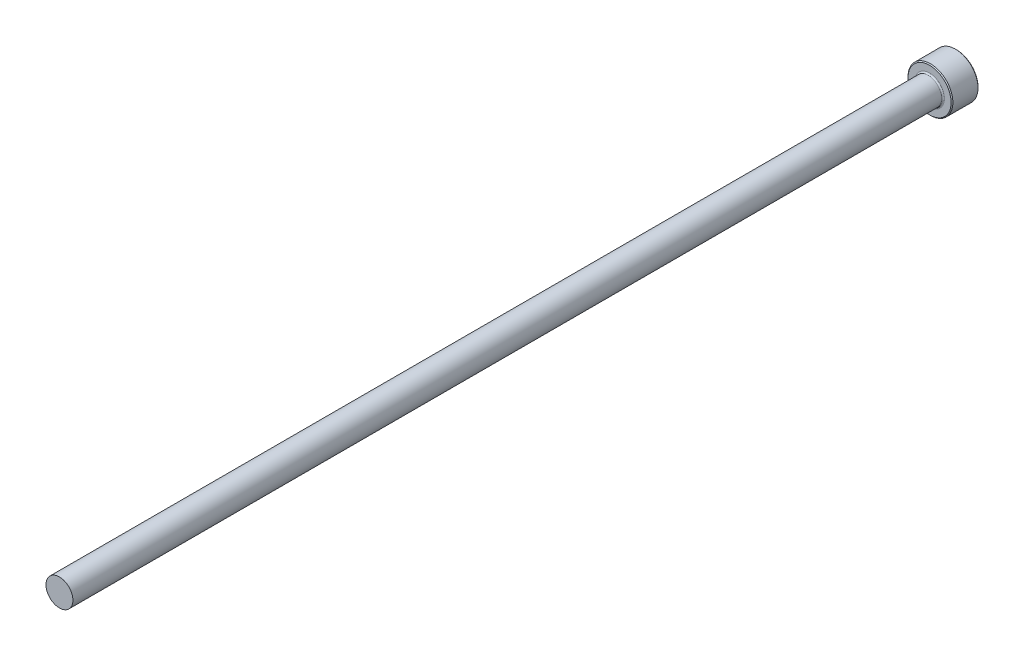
from build123d import *

# Parameters (mm, degrees)
CHAMFER1_SIZE = 0.2


with BuildPart() as part:
    # Sketch1 → Revolve1 (revolve)
    with BuildSketch(Plane(origin=(0, 0, 0), x_dir=(0, 0, -1), z_dir=(1, 0, 0)), mode=Mode.PRIVATE) as revolve1_sk:
        with BuildLine():
            Line((0, 0), (0, 5))
            Line((0, 5), (-6, 5))
            Line((-6, 5), (-6, 3.3))
            ThreePointArc((-6, 3.3), (-6.087867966, 3.087867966), (-6.3, 3))
            Line((-6.3, 3), (-200, 3))
            Line((-200, 3), (-200, 0))
            Line((-200, 0), (0, 0))
        make_face()
    revolve(revolve1_sk.sketch.rotate(Axis((0, 0, 109.05062828), (0, 0, -1)), 90), axis=Axis((0, 0, 109.05062828), (0, 0, -1)))

    # Chamfer1
    chamfer1_edges = [part.edges().sort_by_distance(p)[0] for p in [
        (-5, 0, 0),
        (-5, 0, 6),
    ]]
    chamfer(chamfer1_edges, length=CHAMFER1_SIZE)


solid = part.part
